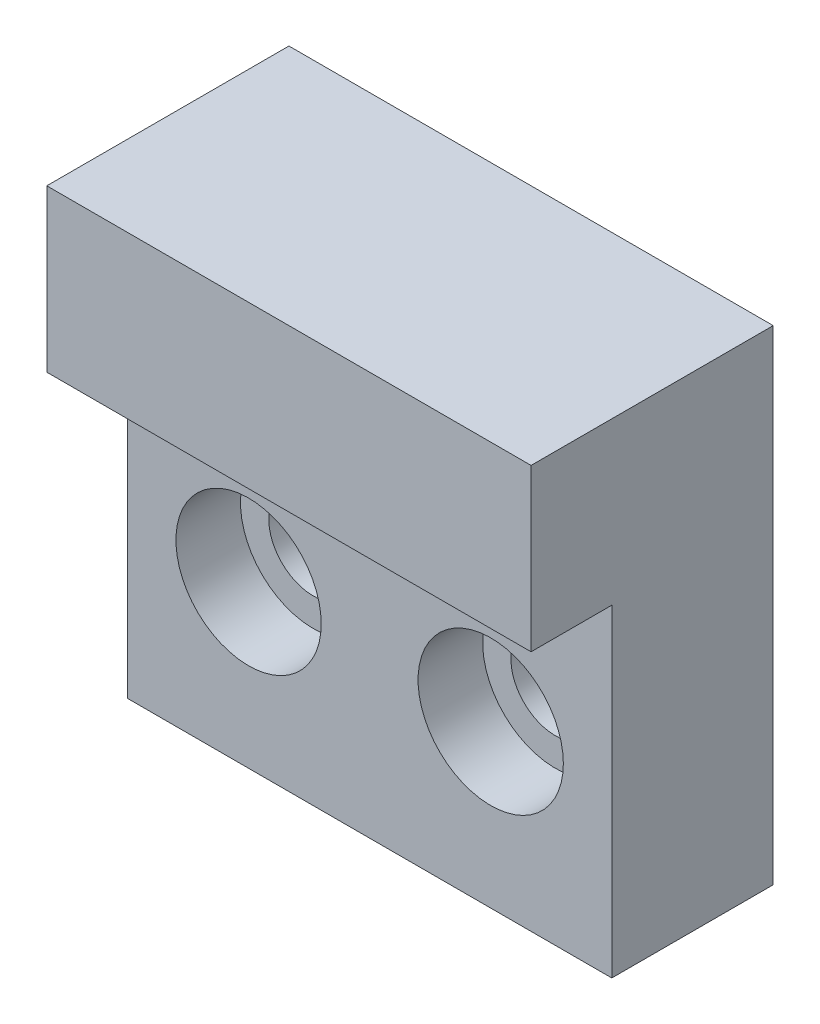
from build123d import *

# Parameters (mm, degrees)
BOSS_EXTRU_1_DEPTH      = 30
ESQUISSE2_R             = 4.5
ENL_V_MAT_EXTRU_1_DEPTH = 4
ESQUISSE3_R             = 2.75
ENL_V_MAT_EXTRU_2_DEPTH = 9


with BuildPart() as part:
    # Esquisse1 → Boss.-Extru.1 (new body)
    with BuildSketch(Plane(origin=(0, 0, 0), x_dir=(0, 0, -1), z_dir=(1, 0, 0))):
        Polygon((0, 0), (0, 30), (-15, 30), (-15, 20), (-10, 20), (-10, 0), align=None)
    extrude(amount=BOSS_EXTRU_1_DEPTH)

    # Esquisse2 → Enl_v. mat.-Extru.1 (cut)
    with BuildSketch(Plane.XY.offset(10)):
        with Locations((7.5, 10)):
            Circle(ESQUISSE2_R)
        with Locations((22.5, 10)):
            Circle(ESQUISSE2_R)
    extrude(amount=-ENL_V_MAT_EXTRU_1_DEPTH, mode=Mode.SUBTRACT)

    # Esquisse3 → Enl_v. mat.-Extru.2 (cut)
    with BuildSketch(Plane.XY.offset(6)):
        with Locations((22.5, 10)):
            Circle(ESQUISSE3_R)
        with Locations((7.5, 10)):
            Circle(ESQUISSE3_R)
    extrude(amount=-ENL_V_MAT_EXTRU_2_DEPTH, mode=Mode.SUBTRACT)


solid = part.part
